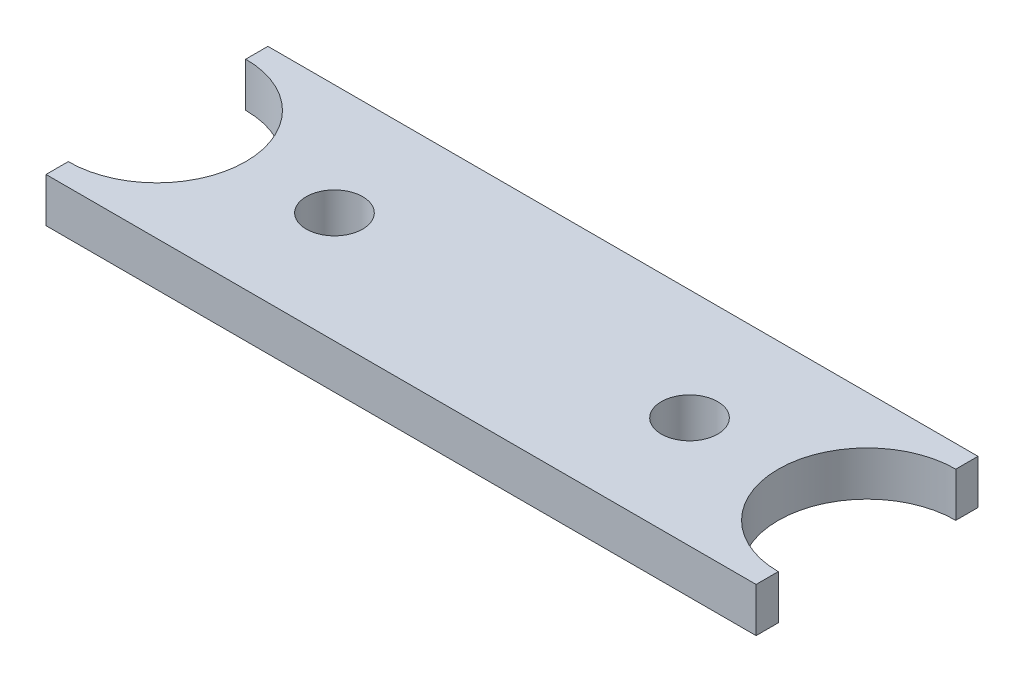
ISO-10303-21;
HEADER;
FILE_DESCRIPTION(('STEP AP214'),'2;1');
FILE_NAME('part.step','',(''),(''),'','','');
FILE_SCHEMA(('AUTOMOTIVE_DESIGN { 1 0 10303 214 1 1 1 1 }'));
ENDSEC;
DATA;
#1=APPLICATION_CONTEXT('core data for automotive mechanical design processes');
#2=APPLICATION_PROTOCOL_DEFINITION('international standard','automotive_design',2000,#1);
#3=PRODUCT_CONTEXT('',#1,'mechanical');
#4=PRODUCT('Part','Part','',(#3));
#5=PRODUCT_RELATED_PRODUCT_CATEGORY('part','',(#4));
#6=PRODUCT_DEFINITION_FORMATION('','',#4);
#7=PRODUCT_DEFINITION_CONTEXT('part definition',#1,'design');
#8=PRODUCT_DEFINITION('design','',#6,#7);
#9=PRODUCT_DEFINITION_SHAPE('','',#8);
#10=(LENGTH_UNIT() NAMED_UNIT(*) SI_UNIT(.MILLI.,.METRE.));
#11=(NAMED_UNIT(*) PLANE_ANGLE_UNIT() SI_UNIT($,.RADIAN.));
#12=(NAMED_UNIT(*) SI_UNIT($,.STERADIAN.) SOLID_ANGLE_UNIT());
#13=UNCERTAINTY_MEASURE_WITH_UNIT(LENGTH_MEASURE(1.E-05),#10,'distance_accuracy_value','');
#14=(GEOMETRIC_REPRESENTATION_CONTEXT(3) GLOBAL_UNCERTAINTY_ASSIGNED_CONTEXT((#13)) GLOBAL_UNIT_ASSIGNED_CONTEXT((#10,
#11,#12)) REPRESENTATION_CONTEXT('',''));
#15=CARTESIAN_POINT('',(0.,0.,0.));
#16=DIRECTION('',(0.,0.,1.));
#17=DIRECTION('',(1.,0.,0.));
#18=AXIS2_PLACEMENT_3D('',#15,#16,#17);
#19=CARTESIAN_POINT('',(40.,5.,0.));
#20=DIRECTION('',(0.,1.,0.));
#21=DIRECTION('',(0.,0.,1.));
#22=AXIS2_PLACEMENT_3D('',#19,#20,#21);
#23=PLANE('',#22);
#24=CARTESIAN_POINT('',(20.,5.,0.));
#25=DIRECTION('',(0.,1.,0.));
#26=DIRECTION('',(0.,0.,1.));
#27=AXIS2_PLACEMENT_3D('',#24,#25,#26);
#28=CIRCLE('',#27,3.175);
#29=CARTESIAN_POINT('',(20.,5.,3.175));
#30=VERTEX_POINT('',#29);
#31=EDGE_CURVE('E115',#30,#30,#28,.T.);
#32=ORIENTED_EDGE('',*,*,#31,.F.);
#33=EDGE_LOOP('',(#32));
#34=FACE_BOUND('',#33,.T.);
#35=DIRECTION('',(0.,0.,-1.));
#36=VECTOR('',#35,1.);
#37=CARTESIAN_POINT('',(40.,5.,-12.5));
#38=LINE('',#37,#36);
#39=CARTESIAN_POINT('',(40.,5.,-10.));
#40=VERTEX_POINT('',#39);
#41=CARTESIAN_POINT('',(40.,5.,-12.5));
#42=VERTEX_POINT('',#41);
#43=EDGE_CURVE('E133',#40,#42,#38,.T.);
#44=ORIENTED_EDGE('',*,*,#43,.T.);
#45=DIRECTION('',(-1.,0.,0.));
#46=VECTOR('',#45,1.);
#47=CARTESIAN_POINT('',(-40.,5.,-12.5));
#48=LINE('',#47,#46);
#49=CARTESIAN_POINT('',(-40.,5.,-12.5));
#50=VERTEX_POINT('',#49);
#51=EDGE_CURVE('E110',#42,#50,#48,.T.);
#52=ORIENTED_EDGE('',*,*,#51,.T.);
#53=DIRECTION('',(0.,0.,1.));
#54=VECTOR('',#53,1.);
#55=CARTESIAN_POINT('',(-40.,5.,-12.5));
#56=LINE('',#55,#54);
#57=CARTESIAN_POINT('',(-40.,5.,-10.));
#58=VERTEX_POINT('',#57);
#59=EDGE_CURVE('E136',#50,#58,#56,.T.);
#60=ORIENTED_EDGE('',*,*,#59,.T.);
#61=CARTESIAN_POINT('',(-40.,5.,0.));
#62=DIRECTION('',(0.,-1.,0.));
#63=DIRECTION('',(0.,0.,-1.));
#64=AXIS2_PLACEMENT_3D('',#61,#62,#63);
#65=CIRCLE('',#64,10.);
#66=CARTESIAN_POINT('',(-40.,5.,10.));
#67=VERTEX_POINT('',#66);
#68=EDGE_CURVE('E138',#58,#67,#65,.T.);
#69=ORIENTED_EDGE('',*,*,#68,.T.);
#70=DIRECTION('',(0.,0.,1.));
#71=VECTOR('',#70,1.);
#72=CARTESIAN_POINT('',(-40.,5.,12.5));
#73=LINE('',#72,#71);
#74=CARTESIAN_POINT('',(-40.,5.,12.5));
#75=VERTEX_POINT('',#74);
#76=EDGE_CURVE('E140',#67,#75,#73,.T.);
#77=ORIENTED_EDGE('',*,*,#76,.T.);
#78=DIRECTION('',(1.,0.,0.));
#79=VECTOR('',#78,1.);
#80=CARTESIAN_POINT('',(-40.,5.,12.5));
#81=LINE('',#80,#79);
#82=CARTESIAN_POINT('',(40.,5.,12.5));
#83=VERTEX_POINT('',#82);
#84=EDGE_CURVE('E142',#75,#83,#81,.T.);
#85=ORIENTED_EDGE('',*,*,#84,.T.);
#86=DIRECTION('',(0.,0.,-1.));
#87=VECTOR('',#86,1.);
#88=CARTESIAN_POINT('',(40.,5.,12.5));
#89=LINE('',#88,#87);
#90=CARTESIAN_POINT('',(40.,5.,10.));
#91=VERTEX_POINT('',#90);
#92=EDGE_CURVE('E51',#83,#91,#89,.T.);
#93=ORIENTED_EDGE('',*,*,#92,.T.);
#94=CARTESIAN_POINT('',(40.,5.,0.));
#95=DIRECTION('',(0.,-1.,0.));
#96=DIRECTION('',(0.,0.,1.));
#97=AXIS2_PLACEMENT_3D('',#94,#95,#96);
#98=CIRCLE('',#97,10.);
#99=EDGE_CURVE('E46',#91,#40,#98,.T.);
#100=ORIENTED_EDGE('',*,*,#99,.T.);
#101=EDGE_LOOP('',(#44,#52,#60,#69,#77,#85,#93,#100));
#102=FACE_BOUND('',#101,.T.);
#103=CARTESIAN_POINT('',(-20.,5.,0.));
#104=DIRECTION('',(0.,1.,0.));
#105=DIRECTION('',(0.,0.,1.));
#106=AXIS2_PLACEMENT_3D('',#103,#104,#105);
#107=CIRCLE('',#106,3.175);
#108=CARTESIAN_POINT('',(-20.,5.,3.175));
#109=VERTEX_POINT('',#108);
#110=EDGE_CURVE('E213',#109,#109,#107,.T.);
#111=ORIENTED_EDGE('',*,*,#110,.F.);
#112=EDGE_LOOP('',(#111));
#113=FACE_BOUND('',#112,.T.);
#114=ADVANCED_FACE('F31',(#34,#102,#113),#23,.T.);
#115=CARTESIAN_POINT('',(40.,0.,0.));
#116=DIRECTION('',(0.,1.,0.));
#117=DIRECTION('',(0.,0.,1.));
#118=AXIS2_PLACEMENT_3D('',#115,#116,#117);
#119=PLANE('',#118);
#120=CARTESIAN_POINT('',(20.,0.,0.));
#121=DIRECTION('',(0.,1.,0.));
#122=DIRECTION('',(0.,0.,1.));
#123=AXIS2_PLACEMENT_3D('',#120,#121,#122);
#124=CIRCLE('',#123,3.175);
#125=CARTESIAN_POINT('',(20.,0.,3.175));
#126=VERTEX_POINT('',#125);
#127=EDGE_CURVE('E118',#126,#126,#124,.T.);
#128=ORIENTED_EDGE('',*,*,#127,.T.);
#129=EDGE_LOOP('',(#128));
#130=FACE_BOUND('',#129,.T.);
#131=DIRECTION('',(0.,0.,-1.));
#132=VECTOR('',#131,1.);
#133=CARTESIAN_POINT('',(40.,0.,-12.5));
#134=LINE('',#133,#132);
#135=CARTESIAN_POINT('',(40.,0.,-10.));
#136=VERTEX_POINT('',#135);
#137=CARTESIAN_POINT('',(40.,0.,-12.5));
#138=VERTEX_POINT('',#137);
#139=EDGE_CURVE('E101',#136,#138,#134,.T.);
#140=ORIENTED_EDGE('',*,*,#139,.F.);
#141=CARTESIAN_POINT('',(40.,0.,0.));
#142=DIRECTION('',(0.,-1.,0.));
#143=DIRECTION('',(0.,0.,1.));
#144=AXIS2_PLACEMENT_3D('',#141,#142,#143);
#145=CIRCLE('',#144,10.);
#146=CARTESIAN_POINT('',(40.,0.,10.));
#147=VERTEX_POINT('',#146);
#148=EDGE_CURVE('E131',#147,#136,#145,.T.);
#149=ORIENTED_EDGE('',*,*,#148,.F.);
#150=DIRECTION('',(0.,0.,-1.));
#151=VECTOR('',#150,1.);
#152=CARTESIAN_POINT('',(40.,0.,12.5));
#153=LINE('',#152,#151);
#154=CARTESIAN_POINT('',(40.,0.,12.5));
#155=VERTEX_POINT('',#154);
#156=EDGE_CURVE('E129',#155,#147,#153,.T.);
#157=ORIENTED_EDGE('',*,*,#156,.F.);
#158=DIRECTION('',(1.,0.,0.));
#159=VECTOR('',#158,1.);
#160=CARTESIAN_POINT('',(-40.,0.,12.5));
#161=LINE('',#160,#159);
#162=CARTESIAN_POINT('',(-40.,0.,12.5));
#163=VERTEX_POINT('',#162);
#164=EDGE_CURVE('E127',#163,#155,#161,.T.);
#165=ORIENTED_EDGE('',*,*,#164,.F.);
#166=DIRECTION('',(0.,0.,1.));
#167=VECTOR('',#166,1.);
#168=CARTESIAN_POINT('',(-40.,0.,12.5));
#169=LINE('',#168,#167);
#170=CARTESIAN_POINT('',(-40.,0.,10.));
#171=VERTEX_POINT('',#170);
#172=EDGE_CURVE('E125',#171,#163,#169,.T.);
#173=ORIENTED_EDGE('',*,*,#172,.F.);
#174=CARTESIAN_POINT('',(-40.,0.,0.));
#175=DIRECTION('',(0.,-1.,0.));
#176=DIRECTION('',(0.,0.,-1.));
#177=AXIS2_PLACEMENT_3D('',#174,#175,#176);
#178=CIRCLE('',#177,10.);
#179=CARTESIAN_POINT('',(-40.,0.,-10.));
#180=VERTEX_POINT('',#179);
#181=EDGE_CURVE('E123',#180,#171,#178,.T.);
#182=ORIENTED_EDGE('',*,*,#181,.F.);
#183=DIRECTION('',(0.,0.,1.));
#184=VECTOR('',#183,1.);
#185=CARTESIAN_POINT('',(-40.,0.,-12.5));
#186=LINE('',#185,#184);
#187=CARTESIAN_POINT('',(-40.,0.,-12.5));
#188=VERTEX_POINT('',#187);
#189=EDGE_CURVE('E103',#188,#180,#186,.T.);
#190=ORIENTED_EDGE('',*,*,#189,.F.);
#191=DIRECTION('',(-1.,0.,0.));
#192=VECTOR('',#191,1.);
#193=CARTESIAN_POINT('',(-40.,0.,-12.5));
#194=LINE('',#193,#192);
#195=EDGE_CURVE('E96',#138,#188,#194,.T.);
#196=ORIENTED_EDGE('',*,*,#195,.F.);
#197=EDGE_LOOP('',(#140,#149,#157,#165,#173,#182,#190,#196));
#198=FACE_BOUND('',#197,.T.);
#199=CARTESIAN_POINT('',(-20.,0.,0.));
#200=DIRECTION('',(0.,1.,0.));
#201=DIRECTION('',(0.,0.,1.));
#202=AXIS2_PLACEMENT_3D('',#199,#200,#201);
#203=CIRCLE('',#202,3.175);
#204=CARTESIAN_POINT('',(-20.,0.,3.175));
#205=VERTEX_POINT('',#204);
#206=EDGE_CURVE('E216',#205,#205,#203,.T.);
#207=ORIENTED_EDGE('',*,*,#206,.T.);
#208=EDGE_LOOP('',(#207));
#209=FACE_BOUND('',#208,.T.);
#210=ADVANCED_FACE('F97',(#130,#198,#209),#119,.F.);
#211=CARTESIAN_POINT('',(40.,5.,-12.5));
#212=DIRECTION('',(-1.,0.,0.));
#213=DIRECTION('',(0.,0.,1.));
#214=AXIS2_PLACEMENT_3D('',#211,#212,#213);
#215=PLANE('',#214);
#216=ORIENTED_EDGE('',*,*,#139,.T.);
#217=DIRECTION('',(0.,-1.,0.));
#218=VECTOR('',#217,1.);
#219=CARTESIAN_POINT('',(40.,5.,-12.5));
#220=LINE('',#219,#218);
#221=EDGE_CURVE('E11',#42,#138,#220,.T.);
#222=ORIENTED_EDGE('',*,*,#221,.F.);
#223=ORIENTED_EDGE('',*,*,#43,.F.);
#224=DIRECTION('',(0.,-1.,0.));
#225=VECTOR('',#224,1.);
#226=CARTESIAN_POINT('',(40.,5.,-10.));
#227=LINE('',#226,#225);
#228=EDGE_CURVE('E114',#40,#136,#227,.T.);
#229=ORIENTED_EDGE('',*,*,#228,.T.);
#230=EDGE_LOOP('',(#216,#222,#223,#229));
#231=FACE_BOUND('',#230,.T.);
#232=ADVANCED_FACE('F33',(#231),#215,.F.);
#233=CARTESIAN_POINT('',(-40.,5.,-12.5));
#234=DIRECTION('',(0.,0.,1.));
#235=DIRECTION('',(1.,0.,0.));
#236=AXIS2_PLACEMENT_3D('',#233,#234,#235);
#237=PLANE('',#236);
#238=ORIENTED_EDGE('',*,*,#195,.T.);
#239=DIRECTION('',(0.,-1.,0.));
#240=VECTOR('',#239,1.);
#241=CARTESIAN_POINT('',(-40.,5.,-12.5));
#242=LINE('',#241,#240);
#243=EDGE_CURVE('E39',#50,#188,#242,.T.);
#244=ORIENTED_EDGE('',*,*,#243,.F.);
#245=ORIENTED_EDGE('',*,*,#51,.F.);
#246=ORIENTED_EDGE('',*,*,#221,.T.);
#247=EDGE_LOOP('',(#238,#244,#245,#246));
#248=FACE_BOUND('',#247,.T.);
#249=ADVANCED_FACE('F109',(#248),#237,.F.);
#250=CARTESIAN_POINT('',(-40.,5.,-12.5));
#251=DIRECTION('',(1.,0.,0.));
#252=DIRECTION('',(0.,0.,-1.));
#253=AXIS2_PLACEMENT_3D('',#250,#251,#252);
#254=PLANE('',#253);
#255=ORIENTED_EDGE('',*,*,#189,.T.);
#256=DIRECTION('',(0.,-1.,0.));
#257=VECTOR('',#256,1.);
#258=CARTESIAN_POINT('',(-40.,5.,-10.));
#259=LINE('',#258,#257);
#260=EDGE_CURVE('E159',#58,#180,#259,.T.);
#261=ORIENTED_EDGE('',*,*,#260,.F.);
#262=ORIENTED_EDGE('',*,*,#59,.F.);
#263=ORIENTED_EDGE('',*,*,#243,.T.);
#264=EDGE_LOOP('',(#255,#261,#262,#263));
#265=FACE_BOUND('',#264,.T.);
#266=ADVANCED_FACE('F163',(#265),#254,.F.);
#267=CARTESIAN_POINT('',(-40.,5.,0.));
#268=DIRECTION('',(0.,-1.,0.));
#269=DIRECTION('',(0.,0.,-1.));
#270=AXIS2_PLACEMENT_3D('',#267,#268,#269);
#271=CYLINDRICAL_SURFACE('',#270,10.);
#272=ORIENTED_EDGE('',*,*,#181,.T.);
#273=DIRECTION('',(0.,-1.,0.));
#274=VECTOR('',#273,1.);
#275=CARTESIAN_POINT('',(-40.,5.,10.));
#276=LINE('',#275,#274);
#277=EDGE_CURVE('E156',#67,#171,#276,.T.);
#278=ORIENTED_EDGE('',*,*,#277,.F.);
#279=ORIENTED_EDGE('',*,*,#68,.F.);
#280=ORIENTED_EDGE('',*,*,#260,.T.);
#281=EDGE_LOOP('',(#272,#278,#279,#280));
#282=FACE_BOUND('',#281,.T.);
#283=ADVANCED_FACE('F171',(#282),#271,.F.);
#284=CARTESIAN_POINT('',(-40.,5.,12.5));
#285=DIRECTION('',(1.,0.,0.));
#286=DIRECTION('',(0.,0.,-1.));
#287=AXIS2_PLACEMENT_3D('',#284,#285,#286);
#288=PLANE('',#287);
#289=ORIENTED_EDGE('',*,*,#172,.T.);
#290=DIRECTION('',(0.,-1.,0.));
#291=VECTOR('',#290,1.);
#292=CARTESIAN_POINT('',(-40.,5.,12.5));
#293=LINE('',#292,#291);
#294=EDGE_CURVE('E153',#75,#163,#293,.T.);
#295=ORIENTED_EDGE('',*,*,#294,.F.);
#296=ORIENTED_EDGE('',*,*,#76,.F.);
#297=ORIENTED_EDGE('',*,*,#277,.T.);
#298=EDGE_LOOP('',(#289,#295,#296,#297));
#299=FACE_BOUND('',#298,.T.);
#300=ADVANCED_FACE('F174',(#299),#288,.F.);
#301=CARTESIAN_POINT('',(-40.,5.,12.5));
#302=DIRECTION('',(0.,0.,-1.));
#303=DIRECTION('',(-1.,0.,0.));
#304=AXIS2_PLACEMENT_3D('',#301,#302,#303);
#305=PLANE('',#304);
#306=ORIENTED_EDGE('',*,*,#164,.T.);
#307=DIRECTION('',(0.,-1.,0.));
#308=VECTOR('',#307,1.);
#309=CARTESIAN_POINT('',(40.,5.,12.5));
#310=LINE('',#309,#308);
#311=EDGE_CURVE('E150',#83,#155,#310,.T.);
#312=ORIENTED_EDGE('',*,*,#311,.F.);
#313=ORIENTED_EDGE('',*,*,#84,.F.);
#314=ORIENTED_EDGE('',*,*,#294,.T.);
#315=EDGE_LOOP('',(#306,#312,#313,#314));
#316=FACE_BOUND('',#315,.T.);
#317=ADVANCED_FACE('F179',(#316),#305,.F.);
#318=CARTESIAN_POINT('',(40.,5.,12.5));
#319=DIRECTION('',(-1.,0.,0.));
#320=DIRECTION('',(0.,0.,1.));
#321=AXIS2_PLACEMENT_3D('',#318,#319,#320);
#322=PLANE('',#321);
#323=ORIENTED_EDGE('',*,*,#156,.T.);
#324=DIRECTION('',(0.,-1.,0.));
#325=VECTOR('',#324,1.);
#326=CARTESIAN_POINT('',(40.,5.,10.));
#327=LINE('',#326,#325);
#328=EDGE_CURVE('E147',#91,#147,#327,.T.);
#329=ORIENTED_EDGE('',*,*,#328,.F.);
#330=ORIENTED_EDGE('',*,*,#92,.F.);
#331=ORIENTED_EDGE('',*,*,#311,.T.);
#332=EDGE_LOOP('',(#323,#329,#330,#331));
#333=FACE_BOUND('',#332,.T.);
#334=ADVANCED_FACE('F182',(#333),#322,.F.);
#335=CARTESIAN_POINT('',(40.,5.,0.));
#336=DIRECTION('',(0.,-1.,0.));
#337=DIRECTION('',(0.,0.,-1.));
#338=AXIS2_PLACEMENT_3D('',#335,#336,#337);
#339=CYLINDRICAL_SURFACE('',#338,10.);
#340=ORIENTED_EDGE('',*,*,#148,.T.);
#341=ORIENTED_EDGE('',*,*,#228,.F.);
#342=ORIENTED_EDGE('',*,*,#99,.F.);
#343=ORIENTED_EDGE('',*,*,#328,.T.);
#344=EDGE_LOOP('',(#340,#341,#342,#343));
#345=FACE_BOUND('',#344,.T.);
#346=ADVANCED_FACE('F184',(#345),#339,.F.);
#347=CARTESIAN_POINT('',(20.,5.,0.));
#348=DIRECTION('',(0.,-1.,0.));
#349=DIRECTION('',(0.,0.,-1.));
#350=AXIS2_PLACEMENT_3D('',#347,#348,#349);
#351=CYLINDRICAL_SURFACE('',#350,3.175);
#352=ORIENTED_EDGE('',*,*,#31,.T.);
#353=EDGE_LOOP('',(#352));
#354=FACE_BOUND('',#353,.T.);
#355=ORIENTED_EDGE('',*,*,#127,.F.);
#356=EDGE_LOOP('',(#355));
#357=FACE_BOUND('',#356,.T.);
#358=ADVANCED_FACE('F186',(#354,#357),#351,.F.);
#359=CARTESIAN_POINT('',(-20.,5.,0.));
#360=DIRECTION('',(0.,-1.,0.));
#361=DIRECTION('',(0.,0.,-1.));
#362=AXIS2_PLACEMENT_3D('',#359,#360,#361);
#363=CYLINDRICAL_SURFACE('',#362,3.175);
#364=ORIENTED_EDGE('',*,*,#110,.T.);
#365=EDGE_LOOP('',(#364));
#366=FACE_BOUND('',#365,.T.);
#367=ORIENTED_EDGE('',*,*,#206,.F.);
#368=EDGE_LOOP('',(#367));
#369=FACE_BOUND('',#368,.T.);
#370=ADVANCED_FACE('F192',(#366,#369),#363,.F.);
#371=CLOSED_SHELL('',(#114,#210,#232,#249,#266,#283,#300,#317,#334,#346,#358,#370));
#372=MANIFOLD_SOLID_BREP('B2',#371);
#373=ADVANCED_BREP_SHAPE_REPRESENTATION('',(#18,#372),#14);
#374=SHAPE_DEFINITION_REPRESENTATION(#9,#373);
ENDSEC;
END-ISO-10303-21;
